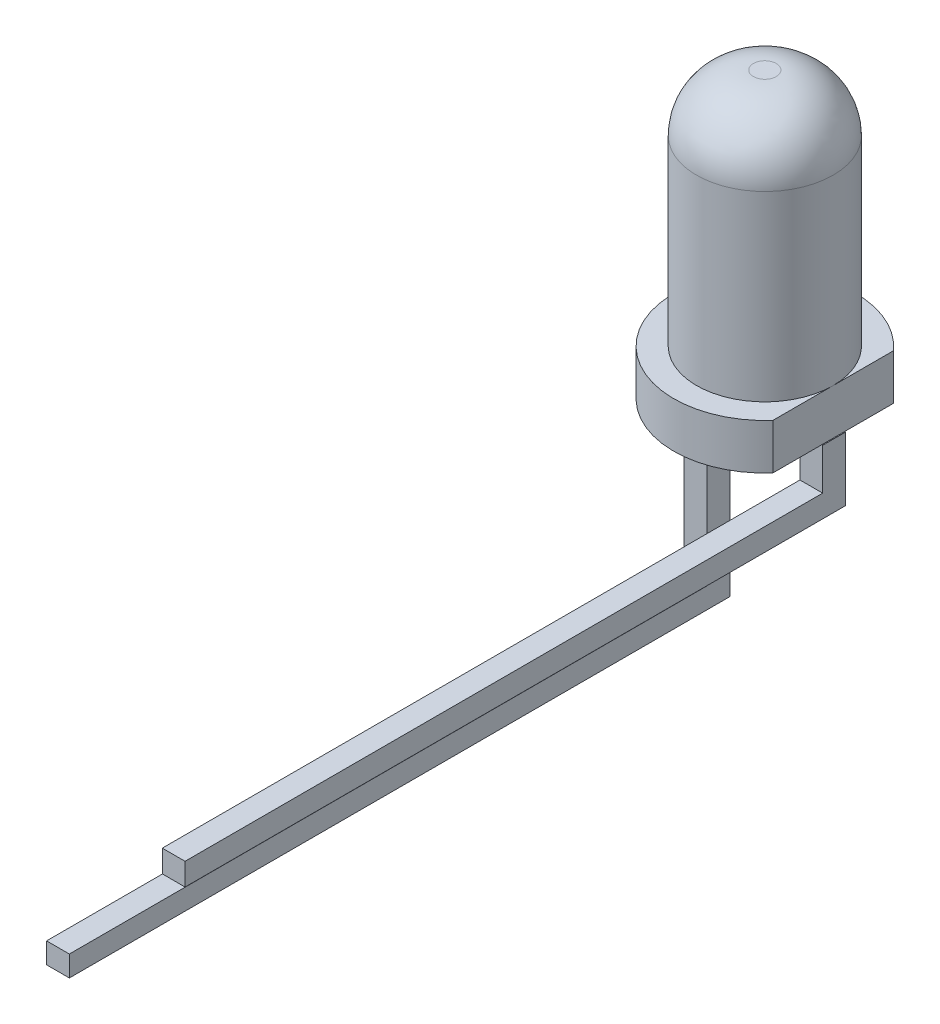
ISO-10303-21;
HEADER;
FILE_DESCRIPTION(('STEP AP214'),'2;1');
FILE_NAME('part.step','',(''),(''),'','','');
FILE_SCHEMA(('AUTOMOTIVE_DESIGN { 1 0 10303 214 1 1 1 1 }'));
ENDSEC;
DATA;
#1=APPLICATION_CONTEXT('core data for automotive mechanical design processes');
#2=APPLICATION_PROTOCOL_DEFINITION('international standard','automotive_design',2000,#1);
#3=PRODUCT_CONTEXT('',#1,'mechanical');
#4=PRODUCT('Part','Part','',(#3));
#5=PRODUCT_RELATED_PRODUCT_CATEGORY('part','',(#4));
#6=PRODUCT_DEFINITION_FORMATION('','',#4);
#7=PRODUCT_DEFINITION_CONTEXT('part definition',#1,'design');
#8=PRODUCT_DEFINITION('design','',#6,#7);
#9=PRODUCT_DEFINITION_SHAPE('','',#8);
#10=(LENGTH_UNIT() NAMED_UNIT(*) SI_UNIT(.MILLI.,.METRE.));
#11=(NAMED_UNIT(*) PLANE_ANGLE_UNIT() SI_UNIT($,.RADIAN.));
#12=(NAMED_UNIT(*) SI_UNIT($,.STERADIAN.) SOLID_ANGLE_UNIT());
#13=UNCERTAINTY_MEASURE_WITH_UNIT(LENGTH_MEASURE(1.E-05),#10,'distance_accuracy_value','');
#14=(GEOMETRIC_REPRESENTATION_CONTEXT(3) GLOBAL_UNCERTAINTY_ASSIGNED_CONTEXT((#13)) GLOBAL_UNIT_ASSIGNED_CONTEXT((#10,
#11,#12)) REPRESENTATION_CONTEXT('',''));
#15=CARTESIAN_POINT('',(0.,0.,0.));
#16=DIRECTION('',(0.,0.,1.));
#17=DIRECTION('',(1.,0.,0.));
#18=AXIS2_PLACEMENT_3D('',#15,#16,#17);
#19=CARTESIAN_POINT('',(-1.52014292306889,-1.4,0.25));
#20=DIRECTION('',(0.,0.,-1.));
#21=DIRECTION('',(1.,0.,0.));
#22=AXIS2_PLACEMENT_3D('',#19,#20,#21);
#23=PLANE('',#22);
#24=DIRECTION('',(1.,0.,0.));
#25=VECTOR('',#24,1.);
#26=CARTESIAN_POINT('',(-1.02014292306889,-3.94389942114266,0.25));
#27=LINE('',#26,#25);
#28=CARTESIAN_POINT('',(-1.52014292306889,-3.94389942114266,0.25));
#29=VERTEX_POINT('',#28);
#30=CARTESIAN_POINT('',(-1.02014292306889,-3.94389942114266,0.25));
#31=VERTEX_POINT('',#30);
#32=EDGE_CURVE('E189',#29,#31,#27,.T.);
#33=ORIENTED_EDGE('',*,*,#32,.T.);
#34=DIRECTION('',(0.,1.,0.));
#35=VECTOR('',#34,1.);
#36=CARTESIAN_POINT('',(-1.02014292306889,-1.4,0.25));
#37=LINE('',#36,#35);
#38=CARTESIAN_POINT('',(-1.02014292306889,0.,0.25));
#39=VERTEX_POINT('',#38);
#40=EDGE_CURVE('E284',#31,#39,#37,.T.);
#41=ORIENTED_EDGE('',*,*,#40,.T.);
#42=DIRECTION('',(1.,0.,0.));
#43=VECTOR('',#42,1.);
#44=CARTESIAN_POINT('',(-1.52014292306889,0.,0.25));
#45=LINE('',#44,#43);
#46=CARTESIAN_POINT('',(-1.52014292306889,0.,0.25));
#47=VERTEX_POINT('',#46);
#48=EDGE_CURVE('E271',#47,#39,#45,.T.);
#49=ORIENTED_EDGE('',*,*,#48,.F.);
#50=DIRECTION('',(0.,1.,0.));
#51=VECTOR('',#50,1.);
#52=CARTESIAN_POINT('',(-1.52014292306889,-1.4,0.25));
#53=LINE('',#52,#51);
#54=EDGE_CURVE('E287',#29,#47,#53,.T.);
#55=ORIENTED_EDGE('',*,*,#54,.F.);
#56=EDGE_LOOP('',(#33,#41,#49,#55));
#57=FACE_BOUND('',#56,.T.);
#58=ADVANCED_FACE('F42',(#57),#23,.F.);
#59=CARTESIAN_POINT('',(1.02017272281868,-1.4,0.25));
#60=DIRECTION('',(0.,0.,-1.));
#61=DIRECTION('',(1.,0.,0.));
#62=AXIS2_PLACEMENT_3D('',#59,#60,#61);
#63=PLANE('',#62);
#64=DIRECTION('',(1.,0.,0.));
#65=VECTOR('',#64,1.);
#66=CARTESIAN_POINT('',(1.02017272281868,-0.91036424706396,0.25));
#67=LINE('',#66,#65);
#68=CARTESIAN_POINT('',(1.02017272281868,-0.91036424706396,0.25));
#69=VERTEX_POINT('',#68);
#70=CARTESIAN_POINT('',(1.52017272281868,-0.91036424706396,0.25));
#71=VERTEX_POINT('',#70);
#72=EDGE_CURVE('E182',#69,#71,#67,.T.);
#73=ORIENTED_EDGE('',*,*,#72,.T.);
#74=DIRECTION('',(0.,1.,0.));
#75=VECTOR('',#74,1.);
#76=CARTESIAN_POINT('',(1.52017272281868,-1.4,0.25));
#77=LINE('',#76,#75);
#78=CARTESIAN_POINT('',(1.52017272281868,0.,0.25));
#79=VERTEX_POINT('',#78);
#80=EDGE_CURVE('E264',#71,#79,#77,.T.);
#81=ORIENTED_EDGE('',*,*,#80,.T.);
#82=DIRECTION('',(-1.,0.,0.));
#83=VECTOR('',#82,1.);
#84=CARTESIAN_POINT('',(1.02017272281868,0.,0.25));
#85=LINE('',#84,#83);
#86=CARTESIAN_POINT('',(1.5,0.,0.25));
#87=VERTEX_POINT('',#86);
#88=EDGE_CURVE('E237',#79,#87,#85,.T.);
#89=ORIENTED_EDGE('',*,*,#88,.T.);
#90=DIRECTION('',(1.,0.,0.));
#91=VECTOR('',#90,1.);
#92=CARTESIAN_POINT('',(1.02017272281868,0.,0.25));
#93=LINE('',#92,#91);
#94=CARTESIAN_POINT('',(1.02017272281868,0.,0.25));
#95=VERTEX_POINT('',#94);
#96=EDGE_CURVE('E253',#95,#87,#93,.T.);
#97=ORIENTED_EDGE('',*,*,#96,.F.);
#98=DIRECTION('',(0.,1.,0.));
#99=VECTOR('',#98,1.);
#100=CARTESIAN_POINT('',(1.02017272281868,-1.4,0.25));
#101=LINE('',#100,#99);
#102=EDGE_CURVE('E267',#69,#95,#101,.T.);
#103=ORIENTED_EDGE('',*,*,#102,.F.);
#104=EDGE_LOOP('',(#73,#81,#89,#97,#103));
#105=FACE_BOUND('',#104,.T.);
#106=ADVANCED_FACE('F321',(#105),#63,.F.);
#107=CARTESIAN_POINT('',(0.,0.,0.));
#108=DIRECTION('',(0.,1.,0.));
#109=DIRECTION('',(0.,0.,-1.));
#110=AXIS2_PLACEMENT_3D('',#107,#108,#109);
#111=PLANE('',#110);
#112=DIRECTION('',(0.,0.,1.));
#113=VECTOR('',#112,1.);
#114=CARTESIAN_POINT('',(-1.52014292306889,0.,0.25));
#115=LINE('',#114,#113);
#116=CARTESIAN_POINT('',(-1.52014292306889,0.,-0.25));
#117=VERTEX_POINT('',#116);
#118=EDGE_CURVE('E269',#117,#47,#115,.T.);
#119=ORIENTED_EDGE('',*,*,#118,.T.);
#120=ORIENTED_EDGE('',*,*,#48,.T.);
#121=DIRECTION('',(0.,0.,-1.));
#122=VECTOR('',#121,1.);
#123=CARTESIAN_POINT('',(-1.02014292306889,0.,0.25));
#124=LINE('',#123,#122);
#125=CARTESIAN_POINT('',(-1.02014292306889,0.,-0.25));
#126=VERTEX_POINT('',#125);
#127=EDGE_CURVE('E274',#39,#126,#124,.T.);
#128=ORIENTED_EDGE('',*,*,#127,.T.);
#129=DIRECTION('',(-1.,0.,0.));
#130=VECTOR('',#129,1.);
#131=CARTESIAN_POINT('',(-1.52014292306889,0.,-0.25));
#132=LINE('',#131,#130);
#133=EDGE_CURVE('E277',#126,#117,#132,.T.);
#134=ORIENTED_EDGE('',*,*,#133,.T.);
#135=EDGE_LOOP('',(#119,#120,#128,#134));
#136=FACE_BOUND('',#135,.T.);
#137=CARTESIAN_POINT('',(0.,0.,0.));
#138=DIRECTION('',(0.,-1.,0.));
#139=DIRECTION('',(0.,0.,-1.));
#140=AXIS2_PLACEMENT_3D('',#137,#138,#139);
#141=CIRCLE('',#140,2.);
#142=CARTESIAN_POINT('',(1.5,0.,1.3228756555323));
#143=VERTEX_POINT('',#142);
#144=CARTESIAN_POINT('',(1.5,0.,-1.32287565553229));
#145=VERTEX_POINT('',#144);
#146=EDGE_CURVE('E293',#143,#145,#141,.T.);
#147=ORIENTED_EDGE('',*,*,#146,.T.);
#148=DIRECTION('',(0.,0.,1.));
#149=VECTOR('',#148,1.);
#150=CARTESIAN_POINT('',(1.5,0.,2.73044739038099));
#151=LINE('',#150,#149);
#152=CARTESIAN_POINT('',(1.5,0.,-0.25));
#153=VERTEX_POINT('',#152);
#154=EDGE_CURVE('E236',#145,#153,#151,.T.);
#155=ORIENTED_EDGE('',*,*,#154,.T.);
#156=DIRECTION('',(-1.,0.,0.));
#157=VECTOR('',#156,1.);
#158=CARTESIAN_POINT('',(1.02017272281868,0.,-0.25));
#159=LINE('',#158,#157);
#160=CARTESIAN_POINT('',(1.02017272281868,0.,-0.25));
#161=VERTEX_POINT('',#160);
#162=EDGE_CURVE('E258',#153,#161,#159,.T.);
#163=ORIENTED_EDGE('',*,*,#162,.T.);
#164=DIRECTION('',(0.,0.,1.));
#165=VECTOR('',#164,1.);
#166=CARTESIAN_POINT('',(1.02017272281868,0.,0.25));
#167=LINE('',#166,#165);
#168=EDGE_CURVE('E65',#161,#95,#167,.T.);
#169=ORIENTED_EDGE('',*,*,#168,.T.);
#170=ORIENTED_EDGE('',*,*,#96,.T.);
#171=EDGE_CURVE('E233',#87,#143,#151,.T.);
#172=ORIENTED_EDGE('',*,*,#171,.T.);
#173=EDGE_LOOP('',(#147,#155,#163,#169,#170,#172));
#174=FACE_BOUND('',#173,.T.);
#175=ADVANCED_FACE('F327',(#136,#174),#111,.F.);
#176=CARTESIAN_POINT('',(0.,1.,0.));
#177=DIRECTION('',(0.,1.,0.));
#178=DIRECTION('',(0.,0.,-1.));
#179=AXIS2_PLACEMENT_3D('',#176,#177,#178);
#180=PLANE('',#179);
#181=DIRECTION('',(0.,0.,-1.));
#182=VECTOR('',#181,1.);
#183=CARTESIAN_POINT('',(1.5,1.,2.73044739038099));
#184=LINE('',#183,#182);
#185=CARTESIAN_POINT('',(1.5,1.,1.3228756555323));
#186=VERTEX_POINT('',#185);
#187=CARTESIAN_POINT('',(1.5,1.,0.));
#188=VERTEX_POINT('',#187);
#189=EDGE_CURVE('E232',#186,#188,#184,.T.);
#190=ORIENTED_EDGE('',*,*,#189,.T.);
#191=CARTESIAN_POINT('',(0.,1.,0.));
#192=DIRECTION('',(0.,-1.,0.));
#193=DIRECTION('',(0.,0.,-1.));
#194=AXIS2_PLACEMENT_3D('',#191,#192,#193);
#195=CIRCLE('',#194,1.5);
#196=EDGE_CURVE('E290',#188,#188,#195,.T.);
#197=ORIENTED_EDGE('',*,*,#196,.T.);
#198=CARTESIAN_POINT('',(1.5,1.,-1.32287565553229));
#199=VERTEX_POINT('',#198);
#200=EDGE_CURVE('E229',#188,#199,#184,.T.);
#201=ORIENTED_EDGE('',*,*,#200,.T.);
#202=CARTESIAN_POINT('',(0.,1.,0.));
#203=DIRECTION('',(0.,-1.,0.));
#204=DIRECTION('',(0.,0.,-1.));
#205=AXIS2_PLACEMENT_3D('',#202,#203,#204);
#206=CIRCLE('',#205,2.);
#207=EDGE_CURVE('E294',#186,#199,#206,.T.);
#208=ORIENTED_EDGE('',*,*,#207,.F.);
#209=EDGE_LOOP('',(#190,#197,#201,#208));
#210=FACE_BOUND('',#209,.T.);
#211=ADVANCED_FACE('F514',(#210),#180,.T.);
#212=CARTESIAN_POINT('',(0.,1.,0.));
#213=DIRECTION('',(0.,-1.,0.));
#214=DIRECTION('',(0.,0.,1.));
#215=AXIS2_PLACEMENT_3D('',#212,#213,#214);
#216=CYLINDRICAL_SURFACE('',#215,2.);
#217=ORIENTED_EDGE('',*,*,#207,.T.);
#218=DIRECTION('',(0.,-1.,0.));
#219=VECTOR('',#218,1.);
#220=CARTESIAN_POINT('',(1.5,1.,-1.32287565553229));
#221=LINE('',#220,#219);
#222=EDGE_CURVE('E297',#145,#199,#221,.F.);
#223=ORIENTED_EDGE('',*,*,#222,.F.);
#224=ORIENTED_EDGE('',*,*,#146,.F.);
#225=DIRECTION('',(0.,-1.,0.));
#226=VECTOR('',#225,1.);
#227=CARTESIAN_POINT('',(1.5,1.,1.3228756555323));
#228=LINE('',#227,#226);
#229=EDGE_CURVE('E301',#186,#143,#228,.T.);
#230=ORIENTED_EDGE('',*,*,#229,.F.);
#231=EDGE_LOOP('',(#217,#223,#224,#230));
#232=FACE_BOUND('',#231,.T.);
#233=ADVANCED_FACE('F317',(#232),#216,.T.);
#234=CARTESIAN_POINT('',(0.,6.25,0.));
#235=DIRECTION('',(0.,-1.,0.));
#236=DIRECTION('',(0.,0.,1.));
#237=AXIS2_PLACEMENT_3D('',#234,#235,#236);
#238=CYLINDRICAL_SURFACE('',#237,1.5);
#239=CARTESIAN_POINT('',(0.,5.,0.));
#240=DIRECTION('',(0.,-1.,0.));
#241=DIRECTION('',(0.,0.,-1.));
#242=AXIS2_PLACEMENT_3D('',#239,#240,#241);
#243=CIRCLE('',#242,1.5);
#244=CARTESIAN_POINT('',(0.,5.,-1.5));
#245=VERTEX_POINT('',#244);
#246=EDGE_CURVE('E12',#245,#245,#243,.F.);
#247=ORIENTED_EDGE('',*,*,#246,.F.);
#248=EDGE_LOOP('',(#247));
#249=FACE_BOUND('',#248,.T.);
#250=ORIENTED_EDGE('',*,*,#196,.F.);
#251=EDGE_LOOP('',(#250));
#252=FACE_BOUND('',#251,.T.);
#253=ADVANCED_FACE('F309',(#249,#252),#238,.T.);
#254=CARTESIAN_POINT('',(0.,6.25,0.));
#255=DIRECTION('',(0.,1.,0.));
#256=DIRECTION('',(0.,0.,-1.));
#257=AXIS2_PLACEMENT_3D('',#254,#255,#256);
#258=PLANE('',#257);
#259=CARTESIAN_POINT('',(0.,6.25,0.));
#260=DIRECTION('',(0.,-1.,0.));
#261=DIRECTION('',(0.,0.,-1.));
#262=AXIS2_PLACEMENT_3D('',#259,#260,#261);
#263=CIRCLE('',#262,0.25);
#264=CARTESIAN_POINT('',(0.,6.25,-0.25));
#265=VERTEX_POINT('',#264);
#266=EDGE_CURVE('E50',#265,#265,#263,.T.);
#267=ORIENTED_EDGE('',*,*,#266,.F.);
#268=EDGE_LOOP('',(#267));
#269=FACE_BOUND('',#268,.T.);
#270=ADVANCED_FACE('F306',(#269),#258,.T.);
#271=CARTESIAN_POINT('',(-1.52014292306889,-1.4,0.25));
#272=DIRECTION('',(1.,0.,0.));
#273=DIRECTION('',(0.,0.,1.));
#274=AXIS2_PLACEMENT_3D('',#271,#272,#273);
#275=PLANE('',#274);
#276=ORIENTED_EDGE('',*,*,#118,.F.);
#277=DIRECTION('',(0.,1.,0.));
#278=VECTOR('',#277,1.);
#279=CARTESIAN_POINT('',(-1.52014292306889,-1.4,-0.25));
#280=LINE('',#279,#278);
#281=CARTESIAN_POINT('',(-1.52014292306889,-4.4,-0.25));
#282=VERTEX_POINT('',#281);
#283=EDGE_CURVE('E280',#282,#117,#280,.T.);
#284=ORIENTED_EDGE('',*,*,#283,.F.);
#285=DIRECTION('',(0.,0.,1.));
#286=VECTOR('',#285,1.);
#287=CARTESIAN_POINT('',(-1.52014292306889,-4.4,-0.25));
#288=LINE('',#287,#286);
#289=CARTESIAN_POINT('',(-1.52014292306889,-4.4,14.25));
#290=VERTEX_POINT('',#289);
#291=EDGE_CURVE('E183',#282,#290,#288,.T.);
#292=ORIENTED_EDGE('',*,*,#291,.T.);
#293=DIRECTION('',(0.,1.,0.));
#294=VECTOR('',#293,1.);
#295=CARTESIAN_POINT('',(-1.52014292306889,-4.4,14.25));
#296=LINE('',#295,#294);
#297=CARTESIAN_POINT('',(-1.52014292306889,-3.94389942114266,14.25));
#298=VERTEX_POINT('',#297);
#299=EDGE_CURVE('E169',#290,#298,#296,.T.);
#300=ORIENTED_EDGE('',*,*,#299,.T.);
#301=DIRECTION('',(0.,0.,-1.));
#302=VECTOR('',#301,1.);
#303=CARTESIAN_POINT('',(-1.52014292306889,-3.94389942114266,14.25));
#304=LINE('',#303,#302);
#305=EDGE_CURVE('E202',#298,#29,#304,.T.);
#306=ORIENTED_EDGE('',*,*,#305,.T.);
#307=ORIENTED_EDGE('',*,*,#54,.T.);
#308=EDGE_LOOP('',(#276,#284,#292,#300,#306,#307));
#309=FACE_BOUND('',#308,.T.);
#310=ADVANCED_FACE('F308',(#309),#275,.F.);
#311=CARTESIAN_POINT('',(-1.02014292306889,-1.4,0.25));
#312=DIRECTION('',(-1.,0.,0.));
#313=DIRECTION('',(0.,0.,-1.));
#314=AXIS2_PLACEMENT_3D('',#311,#312,#313);
#315=PLANE('',#314);
#316=ORIENTED_EDGE('',*,*,#127,.F.);
#317=ORIENTED_EDGE('',*,*,#40,.F.);
#318=DIRECTION('',(0.,0.,-1.));
#319=VECTOR('',#318,1.);
#320=CARTESIAN_POINT('',(-1.02014292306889,-3.94389942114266,14.25));
#321=LINE('',#320,#319);
#322=CARTESIAN_POINT('',(-1.02014292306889,-3.94389942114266,14.25));
#323=VERTEX_POINT('',#322);
#324=EDGE_CURVE('E187',#323,#31,#321,.T.);
#325=ORIENTED_EDGE('',*,*,#324,.F.);
#326=DIRECTION('',(0.,-1.,0.));
#327=VECTOR('',#326,1.);
#328=CARTESIAN_POINT('',(-1.02014292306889,-3.94389942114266,14.25));
#329=LINE('',#328,#327);
#330=CARTESIAN_POINT('',(-1.02014292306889,-4.4,14.25));
#331=VERTEX_POINT('',#330);
#332=EDGE_CURVE('E166',#323,#331,#329,.T.);
#333=ORIENTED_EDGE('',*,*,#332,.T.);
#334=DIRECTION('',(0.,0.,-1.));
#335=VECTOR('',#334,1.);
#336=CARTESIAN_POINT('',(-1.02014292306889,-4.4,0.25));
#337=LINE('',#336,#335);
#338=CARTESIAN_POINT('',(-1.02014292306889,-4.4,-0.25));
#339=VERTEX_POINT('',#338);
#340=EDGE_CURVE('E176',#331,#339,#337,.T.);
#341=ORIENTED_EDGE('',*,*,#340,.T.);
#342=DIRECTION('',(0.,1.,0.));
#343=VECTOR('',#342,1.);
#344=CARTESIAN_POINT('',(-1.02014292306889,-1.4,-0.25));
#345=LINE('',#344,#343);
#346=EDGE_CURVE('E282',#339,#126,#345,.T.);
#347=ORIENTED_EDGE('',*,*,#346,.T.);
#348=EDGE_LOOP('',(#316,#317,#325,#333,#341,#347));
#349=FACE_BOUND('',#348,.T.);
#350=ADVANCED_FACE('F185',(#349),#315,.F.);
#351=CARTESIAN_POINT('',(-1.52014292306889,-1.4,-0.25));
#352=DIRECTION('',(0.,0.,1.));
#353=DIRECTION('',(-1.,0.,0.));
#354=AXIS2_PLACEMENT_3D('',#351,#352,#353);
#355=PLANE('',#354);
#356=ORIENTED_EDGE('',*,*,#133,.F.);
#357=ORIENTED_EDGE('',*,*,#346,.F.);
#358=DIRECTION('',(-1.,0.,0.));
#359=VECTOR('',#358,1.);
#360=CARTESIAN_POINT('',(-1.02014292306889,-4.4,-0.25));
#361=LINE('',#360,#359);
#362=EDGE_CURVE('E178',#339,#282,#361,.T.);
#363=ORIENTED_EDGE('',*,*,#362,.T.);
#364=ORIENTED_EDGE('',*,*,#283,.T.);
#365=EDGE_LOOP('',(#356,#357,#363,#364));
#366=FACE_BOUND('',#365,.T.);
#367=ADVANCED_FACE('F333',(#366),#355,.F.);
#368=CARTESIAN_POINT('',(1.02017272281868,-1.4,0.25));
#369=DIRECTION('',(1.,0.,0.));
#370=DIRECTION('',(0.,0.,1.));
#371=AXIS2_PLACEMENT_3D('',#368,#369,#370);
#372=PLANE('',#371);
#373=ORIENTED_EDGE('',*,*,#168,.F.);
#374=DIRECTION('',(0.,1.,0.));
#375=VECTOR('',#374,1.);
#376=CARTESIAN_POINT('',(1.02017272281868,-1.4,-0.25));
#377=LINE('',#376,#375);
#378=CARTESIAN_POINT('',(1.02017272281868,-1.4,-0.25));
#379=VERTEX_POINT('',#378);
#380=EDGE_CURVE('E251',#379,#161,#377,.T.);
#381=ORIENTED_EDGE('',*,*,#380,.F.);
#382=DIRECTION('',(0.,0.,1.));
#383=VECTOR('',#382,1.);
#384=CARTESIAN_POINT('',(1.02017272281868,-1.4,0.25));
#385=LINE('',#384,#383);
#386=CARTESIAN_POINT('',(1.02017272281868,-1.4,14.25));
#387=VERTEX_POINT('',#386);
#388=EDGE_CURVE('E240',#379,#387,#385,.T.);
#389=ORIENTED_EDGE('',*,*,#388,.T.);
#390=DIRECTION('',(0.,1.,0.));
#391=VECTOR('',#390,1.);
#392=CARTESIAN_POINT('',(1.02017272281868,-1.4,14.25));
#393=LINE('',#392,#391);
#394=CARTESIAN_POINT('',(1.02017272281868,-0.91036424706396,14.25));
#395=VERTEX_POINT('',#394);
#396=EDGE_CURVE('E217',#387,#395,#393,.T.);
#397=ORIENTED_EDGE('',*,*,#396,.T.);
#398=DIRECTION('',(0.,0.,-1.));
#399=VECTOR('',#398,1.);
#400=CARTESIAN_POINT('',(1.02017272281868,-0.91036424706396,14.25));
#401=LINE('',#400,#399);
#402=EDGE_CURVE('E221',#395,#69,#401,.T.);
#403=ORIENTED_EDGE('',*,*,#402,.T.);
#404=ORIENTED_EDGE('',*,*,#102,.T.);
#405=EDGE_LOOP('',(#373,#381,#389,#397,#403,#404));
#406=FACE_BOUND('',#405,.T.);
#407=ADVANCED_FACE('F336',(#406),#372,.F.);
#408=CARTESIAN_POINT('',(1.52017272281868,-1.4,0.25));
#409=DIRECTION('',(-1.,0.,0.));
#410=DIRECTION('',(0.,0.,-1.));
#411=AXIS2_PLACEMENT_3D('',#408,#409,#410);
#412=PLANE('',#411);
#413=DIRECTION('',(0.,0.,-1.));
#414=VECTOR('',#413,1.);
#415=CARTESIAN_POINT('',(1.52017272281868,0.,0.25));
#416=LINE('',#415,#414);
#417=CARTESIAN_POINT('',(1.52017272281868,0.,-0.25));
#418=VERTEX_POINT('',#417);
#419=EDGE_CURVE('E255',#79,#418,#416,.T.);
#420=ORIENTED_EDGE('',*,*,#419,.F.);
#421=ORIENTED_EDGE('',*,*,#80,.F.);
#422=DIRECTION('',(0.,0.,-1.));
#423=VECTOR('',#422,1.);
#424=CARTESIAN_POINT('',(1.52017272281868,-0.91036424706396,14.25));
#425=LINE('',#424,#423);
#426=CARTESIAN_POINT('',(1.52017272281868,-0.91036424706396,14.25));
#427=VERTEX_POINT('',#426);
#428=EDGE_CURVE('E226',#427,#71,#425,.T.);
#429=ORIENTED_EDGE('',*,*,#428,.F.);
#430=DIRECTION('',(0.,-1.,0.));
#431=VECTOR('',#430,1.);
#432=CARTESIAN_POINT('',(1.52017272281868,-0.91036424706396,14.25));
#433=LINE('',#432,#431);
#434=CARTESIAN_POINT('',(1.52017272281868,-1.4,14.25));
#435=VERTEX_POINT('',#434);
#436=EDGE_CURVE('E210',#427,#435,#433,.T.);
#437=ORIENTED_EDGE('',*,*,#436,.T.);
#438=DIRECTION('',(0.,0.,-1.));
#439=VECTOR('',#438,1.);
#440=CARTESIAN_POINT('',(1.52017272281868,-1.4,0.25));
#441=LINE('',#440,#439);
#442=CARTESIAN_POINT('',(1.52017272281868,-1.4,-0.25));
#443=VERTEX_POINT('',#442);
#444=EDGE_CURVE('E244',#435,#443,#441,.T.);
#445=ORIENTED_EDGE('',*,*,#444,.T.);
#446=DIRECTION('',(0.,1.,0.));
#447=VECTOR('',#446,1.);
#448=CARTESIAN_POINT('',(1.52017272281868,-1.4,-0.25));
#449=LINE('',#448,#447);
#450=EDGE_CURVE('E261',#443,#418,#449,.T.);
#451=ORIENTED_EDGE('',*,*,#450,.T.);
#452=EDGE_LOOP('',(#420,#421,#429,#437,#445,#451));
#453=FACE_BOUND('',#452,.T.);
#454=ADVANCED_FACE('F339',(#453),#412,.F.);
#455=CARTESIAN_POINT('',(1.02017272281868,-1.4,-0.25));
#456=DIRECTION('',(0.,0.,1.));
#457=DIRECTION('',(-1.,0.,0.));
#458=AXIS2_PLACEMENT_3D('',#455,#456,#457);
#459=PLANE('',#458);
#460=EDGE_CURVE('E245',#418,#153,#159,.T.);
#461=ORIENTED_EDGE('',*,*,#460,.F.);
#462=ORIENTED_EDGE('',*,*,#450,.F.);
#463=DIRECTION('',(-1.,0.,0.));
#464=VECTOR('',#463,1.);
#465=CARTESIAN_POINT('',(1.02017272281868,-1.4,-0.25));
#466=LINE('',#465,#464);
#467=EDGE_CURVE('E249',#443,#379,#466,.T.);
#468=ORIENTED_EDGE('',*,*,#467,.T.);
#469=ORIENTED_EDGE('',*,*,#380,.T.);
#470=ORIENTED_EDGE('',*,*,#162,.F.);
#471=EDGE_LOOP('',(#461,#462,#468,#469,#470));
#472=FACE_BOUND('',#471,.T.);
#473=ADVANCED_FACE('F344',(#472),#459,.F.);
#474=CARTESIAN_POINT('',(1.02017272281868,-1.4,-0.25));
#475=DIRECTION('',(0.,1.,0.));
#476=DIRECTION('',(0.,0.,-1.));
#477=AXIS2_PLACEMENT_3D('',#474,#475,#476);
#478=PLANE('',#477);
#479=ORIENTED_EDGE('',*,*,#388,.F.);
#480=ORIENTED_EDGE('',*,*,#467,.F.);
#481=ORIENTED_EDGE('',*,*,#444,.F.);
#482=DIRECTION('',(-1.,0.,0.));
#483=VECTOR('',#482,1.);
#484=CARTESIAN_POINT('',(1.52017272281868,-1.4,14.25));
#485=LINE('',#484,#483);
#486=EDGE_CURVE('E214',#435,#387,#485,.T.);
#487=ORIENTED_EDGE('',*,*,#486,.T.);
#488=EDGE_LOOP('',(#479,#480,#481,#487));
#489=FACE_BOUND('',#488,.T.);
#490=ADVANCED_FACE('F348',(#489),#478,.F.);
#491=CARTESIAN_POINT('',(1.5,-4.60977222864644,2.73044739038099));
#492=DIRECTION('',(-1.,0.,0.));
#493=DIRECTION('',(0.,0.,-1.));
#494=AXIS2_PLACEMENT_3D('',#491,#492,#493);
#495=PLANE('',#494);
#496=ORIENTED_EDGE('',*,*,#189,.F.);
#497=ORIENTED_EDGE('',*,*,#229,.T.);
#498=ORIENTED_EDGE('',*,*,#171,.F.);
#499=EDGE_CURVE('E57',#153,#87,#151,.T.);
#500=ORIENTED_EDGE('',*,*,#499,.F.);
#501=ORIENTED_EDGE('',*,*,#154,.F.);
#502=ORIENTED_EDGE('',*,*,#222,.T.);
#503=ORIENTED_EDGE('',*,*,#200,.F.);
#504=EDGE_LOOP('',(#496,#497,#498,#500,#501,#502,#503));
#505=FACE_BOUND('',#504,.T.);
#506=ADVANCED_FACE('F352',(#505),#495,.F.);
#507=CARTESIAN_POINT('',(0.,0.,0.));
#508=DIRECTION('',(0.,1.,0.));
#509=DIRECTION('',(0.,0.,-1.));
#510=AXIS2_PLACEMENT_3D('',#507,#508,#509);
#511=PLANE('',#510);
#512=ORIENTED_EDGE('',*,*,#88,.F.);
#513=ORIENTED_EDGE('',*,*,#419,.T.);
#514=ORIENTED_EDGE('',*,*,#460,.T.);
#515=ORIENTED_EDGE('',*,*,#499,.T.);
#516=EDGE_LOOP('',(#512,#513,#514,#515));
#517=FACE_BOUND('',#516,.T.);
#518=ADVANCED_FACE('F356',(#517),#511,.T.);
#519=CARTESIAN_POINT('',(0.,5.,0.));
#520=DIRECTION('',(0.,1.,0.));
#521=DIRECTION('',(0.,0.,-1.));
#522=AXIS2_PLACEMENT_3D('',#519,#520,#521);
#523=DEGENERATE_TOROIDAL_SURFACE('',#522,0.25,1.25,.T.);
#524=ORIENTED_EDGE('',*,*,#246,.T.);
#525=EDGE_LOOP('',(#524));
#526=FACE_BOUND('',#525,.T.);
#527=ORIENTED_EDGE('',*,*,#266,.T.);
#528=EDGE_LOOP('',(#527));
#529=FACE_BOUND('',#528,.T.);
#530=ADVANCED_FACE('F44',(#526,#529),#523,.T.);
#531=CARTESIAN_POINT('',(1.02017272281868,-0.91036424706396,14.25));
#532=DIRECTION('',(0.,-1.,0.));
#533=DIRECTION('',(1.,0.,0.));
#534=AXIS2_PLACEMENT_3D('',#531,#532,#533);
#535=PLANE('',#534);
#536=ORIENTED_EDGE('',*,*,#72,.F.);
#537=ORIENTED_EDGE('',*,*,#402,.F.);
#538=DIRECTION('',(1.,0.,0.));
#539=VECTOR('',#538,1.);
#540=CARTESIAN_POINT('',(1.02017272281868,-0.91036424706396,14.25));
#541=LINE('',#540,#539);
#542=EDGE_CURVE('E207',#395,#427,#541,.T.);
#543=ORIENTED_EDGE('',*,*,#542,.T.);
#544=ORIENTED_EDGE('',*,*,#428,.T.);
#545=EDGE_LOOP('',(#536,#537,#543,#544));
#546=FACE_BOUND('',#545,.T.);
#547=ADVANCED_FACE('F360',(#546),#535,.F.);
#548=CARTESIAN_POINT('',(1.52017272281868,-0.91036424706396,14.25));
#549=DIRECTION('',(0.,0.,1.));
#550=DIRECTION('',(-1.,0.,0.));
#551=AXIS2_PLACEMENT_3D('',#548,#549,#550);
#552=PLANE('',#551);
#553=ORIENTED_EDGE('',*,*,#542,.F.);
#554=ORIENTED_EDGE('',*,*,#396,.F.);
#555=ORIENTED_EDGE('',*,*,#486,.F.);
#556=ORIENTED_EDGE('',*,*,#436,.F.);
#557=EDGE_LOOP('',(#553,#554,#555,#556));
#558=FACE_BOUND('',#557,.T.);
#559=ADVANCED_FACE('F363',(#558),#552,.T.);
#560=CARTESIAN_POINT('',(-1.52014292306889,-4.4,-0.25));
#561=DIRECTION('',(0.,-1.,0.));
#562=DIRECTION('',(0.,0.,1.));
#563=AXIS2_PLACEMENT_3D('',#560,#561,#562);
#564=PLANE('',#563);
#565=ORIENTED_EDGE('',*,*,#362,.F.);
#566=ORIENTED_EDGE('',*,*,#340,.F.);
#567=DIRECTION('',(-1.,0.,0.));
#568=VECTOR('',#567,1.);
#569=CARTESIAN_POINT('',(-1.02014292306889,-4.4,14.25));
#570=LINE('',#569,#568);
#571=EDGE_CURVE('E162',#331,#290,#570,.T.);
#572=ORIENTED_EDGE('',*,*,#571,.T.);
#573=ORIENTED_EDGE('',*,*,#291,.F.);
#574=EDGE_LOOP('',(#565,#566,#572,#573));
#575=FACE_BOUND('',#574,.T.);
#576=ADVANCED_FACE('F177',(#575),#564,.T.);
#577=CARTESIAN_POINT('',(-1.02014292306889,-3.94389942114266,14.25));
#578=DIRECTION('',(0.,-1.,0.));
#579=DIRECTION('',(0.,0.,1.));
#580=AXIS2_PLACEMENT_3D('',#577,#578,#579);
#581=PLANE('',#580);
#582=ORIENTED_EDGE('',*,*,#32,.F.);
#583=ORIENTED_EDGE('',*,*,#305,.F.);
#584=DIRECTION('',(1.,0.,0.));
#585=VECTOR('',#584,1.);
#586=CARTESIAN_POINT('',(-1.02014292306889,-3.94389942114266,14.25));
#587=LINE('',#586,#585);
#588=EDGE_CURVE('E198',#298,#323,#587,.T.);
#589=ORIENTED_EDGE('',*,*,#588,.T.);
#590=ORIENTED_EDGE('',*,*,#324,.T.);
#591=EDGE_LOOP('',(#582,#583,#589,#590));
#592=FACE_BOUND('',#591,.T.);
#593=ADVANCED_FACE('F370',(#592),#581,.F.);
#594=CARTESIAN_POINT('',(-1.02014292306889,-4.4,14.25));
#595=DIRECTION('',(0.,0.,1.));
#596=DIRECTION('',(-1.,0.,0.));
#597=AXIS2_PLACEMENT_3D('',#594,#595,#596);
#598=PLANE('',#597);
#599=ORIENTED_EDGE('',*,*,#332,.F.);
#600=ORIENTED_EDGE('',*,*,#588,.F.);
#601=ORIENTED_EDGE('',*,*,#299,.F.);
#602=ORIENTED_EDGE('',*,*,#571,.F.);
#603=EDGE_LOOP('',(#599,#600,#601,#602));
#604=FACE_BOUND('',#603,.T.);
#605=ADVANCED_FACE('F164',(#604),#598,.T.);
#606=CLOSED_SHELL('',(#58,#106,#175,#211,#233,#253,#270,#310,#350,#367,#407,#454,#473,#490,#506,
#518,#530,#547,#559,#576,#593,#605));
#607=MANIFOLD_SOLID_BREP('B2',#606);
#608=ADVANCED_BREP_SHAPE_REPRESENTATION('',(#18,#607),#14);
#609=SHAPE_DEFINITION_REPRESENTATION(#9,#608);
ENDSEC;
END-ISO-10303-21;
